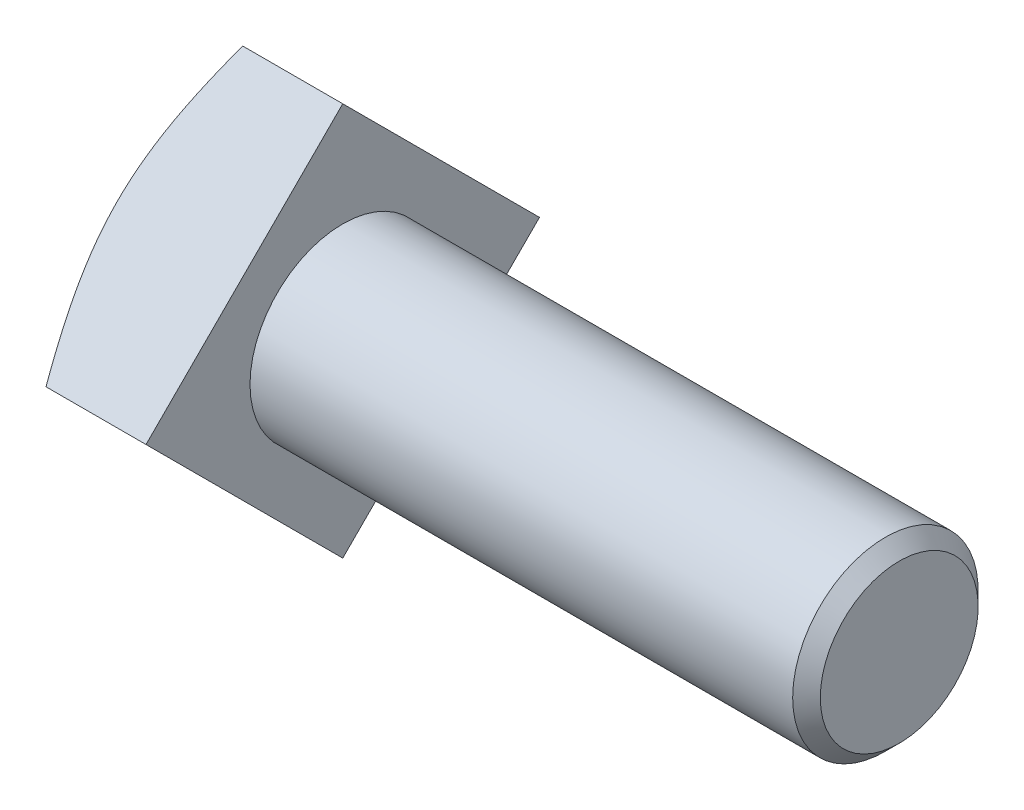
ISO-10303-21;
HEADER;
FILE_DESCRIPTION(('STEP AP214'),'2;1');
FILE_NAME('part.step','',(''),(''),'','','');
FILE_SCHEMA(('AUTOMOTIVE_DESIGN { 1 0 10303 214 1 1 1 1 }'));
ENDSEC;
DATA;
#1=APPLICATION_CONTEXT('core data for automotive mechanical design processes');
#2=APPLICATION_PROTOCOL_DEFINITION('international standard','automotive_design',2000,#1);
#3=PRODUCT_CONTEXT('',#1,'mechanical');
#4=PRODUCT('Part','Part','',(#3));
#5=PRODUCT_RELATED_PRODUCT_CATEGORY('part','',(#4));
#6=PRODUCT_DEFINITION_FORMATION('','',#4);
#7=PRODUCT_DEFINITION_CONTEXT('part definition',#1,'design');
#8=PRODUCT_DEFINITION('design','',#6,#7);
#9=PRODUCT_DEFINITION_SHAPE('','',#8);
#10=(LENGTH_UNIT() NAMED_UNIT(*) SI_UNIT(.MILLI.,.METRE.));
#11=(NAMED_UNIT(*) PLANE_ANGLE_UNIT() SI_UNIT($,.RADIAN.));
#12=(NAMED_UNIT(*) SI_UNIT($,.STERADIAN.) SOLID_ANGLE_UNIT());
#13=UNCERTAINTY_MEASURE_WITH_UNIT(LENGTH_MEASURE(1.E-05),#10,'distance_accuracy_value','');
#14=(GEOMETRIC_REPRESENTATION_CONTEXT(3) GLOBAL_UNCERTAINTY_ASSIGNED_CONTEXT((#13)) GLOBAL_UNIT_ASSIGNED_CONTEXT((#10,
#11,#12)) REPRESENTATION_CONTEXT('',''));
#15=CARTESIAN_POINT('',(0.,0.,0.));
#16=DIRECTION('',(0.,0.,1.));
#17=DIRECTION('',(1.,0.,0.));
#18=AXIS2_PLACEMENT_3D('',#15,#16,#17);
#19=CARTESIAN_POINT('',(17.3736,0.,-26.9407683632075));
#20=DIRECTION('',(0.,-0.707106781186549,0.707106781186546));
#21=DIRECTION('',(0.,-0.707106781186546,-0.707106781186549));
#22=AXIS2_PLACEMENT_3D('',#19,#20,#21);
#23=PLANE('',#22);
#24=CARTESIAN_POINT('',(3.67961897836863,26.9409683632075,0.000200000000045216));
#25=CARTESIAN_POINT('',(3.5548106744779,26.6733023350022,-0.267466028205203));
#26=CARTESIAN_POINT('',(3.43166591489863,26.4052457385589,-0.535522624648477));
#27=CARTESIAN_POINT('',(3.1890899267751,25.8682845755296,-1.0724837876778));
#28=CARTESIAN_POINT('',(3.06965881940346,25.5993799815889,-1.34138838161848));
#29=CARTESIAN_POINT('',(2.83485734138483,25.0605646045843,-1.88020375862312));
#30=CARTESIAN_POINT('',(2.71948863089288,24.7906534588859,-2.15011490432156));
#31=CARTESIAN_POINT('',(2.49331484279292,24.2498808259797,-2.69088753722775));
#32=CARTESIAN_POINT('',(2.38250972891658,23.9790193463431,-2.96174901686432));
#33=CARTESIAN_POINT('',(2.05612530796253,23.1610744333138,-3.77969392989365));
#34=CARTESIAN_POINT('',(1.84824930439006,22.6124346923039,-4.32833367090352));
#35=CARTESIAN_POINT('',(1.45758123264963,21.5107337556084,-5.430034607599));
#36=CARTESIAN_POINT('',(1.27478662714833,20.9576730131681,-5.9830953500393));
#37=CARTESIAN_POINT('',(0.945511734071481,19.8664326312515,-7.07433573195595));
#38=CARTESIAN_POINT('',(0.79798088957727,19.3284131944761,-7.61235516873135));
#39=CARTESIAN_POINT('',(0.536422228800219,18.2482773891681,-8.69249097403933));
#40=CARTESIAN_POINT('',(0.422394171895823,17.7061610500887,-9.23460731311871));
#41=CARTESIAN_POINT('',(0.233146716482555,16.6203771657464,-10.3203911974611));
#42=CARTESIAN_POINT('',(0.157794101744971,16.0767215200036,-10.8640468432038));
#43=CARTESIAN_POINT('',(0.0762638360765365,15.2597076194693,-11.6810607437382));
#44=CARTESIAN_POINT('',(0.0543365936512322,14.9871029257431,-11.9536654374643));
#45=CARTESIAN_POINT('',(0.0212582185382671,14.4415698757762,-12.4991984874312));
#46=CARTESIAN_POINT('',(0.0101066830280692,14.1686415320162,-12.7721268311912));
#47=CARTESIAN_POINT('',(-0.00161011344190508,13.605599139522,-13.3351692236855));
#48=CARTESIAN_POINT('',(-0.00146976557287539,13.3154776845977,-13.6252906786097));
#49=CARTESIAN_POINT('',(0.011159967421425,12.7353688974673,-14.2053994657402));
#50=CARTESIAN_POINT('',(0.0236494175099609,12.4453815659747,-14.4953867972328));
#51=CARTESIAN_POINT('',(0.0607802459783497,11.8657903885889,-15.0749779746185));
#52=CARTESIAN_POINT('',(0.0854218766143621,11.5761865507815,-15.364581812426));
#53=CARTESIAN_POINT('',(0.146470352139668,10.9975953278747,-15.9431730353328));
#54=CARTESIAN_POINT('',(0.182877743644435,10.7086079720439,-16.2321603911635));
#55=CARTESIAN_POINT('',(0.309293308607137,9.84074831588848,-17.100020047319));
#56=CARTESIAN_POINT('',(0.416353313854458,9.26308735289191,-17.6776810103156));
#57=CARTESIAN_POINT('',(0.670258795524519,8.11225138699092,-18.8285169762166));
#58=CARTESIAN_POINT('',(0.81710493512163,7.53907645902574,-19.4016919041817));
#59=CARTESIAN_POINT('',(1.15063001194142,6.37560138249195,-20.5651669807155));
#60=CARTESIAN_POINT('',(1.33862518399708,5.78549181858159,-21.1552765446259));
#61=CARTESIAN_POINT('',(1.74416737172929,4.61034109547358,-22.3304272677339));
#62=CARTESIAN_POINT('',(1.96171822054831,4.0253006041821,-22.9154677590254));
#63=CARTESIAN_POINT('',(2.30502412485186,3.15351567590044,-23.7872526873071));
#64=CARTESIAN_POINT('',(2.42180887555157,2.86498021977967,-24.0757881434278));
#65=CARTESIAN_POINT('',(2.66065189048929,2.28899759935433,-24.6517707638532));
#66=CARTESIAN_POINT('',(2.78271020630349,2.00155044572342,-24.9392179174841));
#67=CARTESIAN_POINT('',(3.03148171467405,1.42782962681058,-25.5129387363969));
#68=CARTESIAN_POINT('',(3.15819248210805,1.14155543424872,-25.7992129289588));
#69=CARTESIAN_POINT('',(3.41584794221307,0.569973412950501,-26.370794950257));
#70=CARTESIAN_POINT('',(3.54679246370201,0.284665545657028,-26.6561028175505));
#71=CARTESIAN_POINT('',(3.67961897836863,-0.000199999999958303,-26.9409683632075));
#72=B_SPLINE_CURVE_WITH_KNOTS('',3,(#24,#25,#26,#27,#28,#29,#30,#31,#32,#33,#34,#35,#36,#37,#38,
#39,#40,#41,#42,#43,#44,#45,#46,#47,#48,#49,#50,#51,#52,#53,#54,#55,#56,#57,#58,#59,#60,#61,#62,
#63,#64,#65,#66,#67,#68,#69,#70,#71),.UNSPECIFIED.,.F.,.F.,(4,2,2,2,2,2,2,2,2,2,2,2,2,2,2,2,2,2,
2,2,2,2,2,4),(0.,1.19574621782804,2.39153141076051,3.5877997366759,4.78405855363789,
7.1934730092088,9.60264353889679,11.9271362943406,14.2516123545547,16.5680271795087,
17.726333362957,18.8845962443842,20.1152898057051,21.3459898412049,22.5767154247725,
23.8074981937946,26.2780083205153,28.7485596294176,31.3142561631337,33.8802857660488,
35.1535601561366,36.4268470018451,37.6994793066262,38.9720602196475),.UNSPECIFIED.);
#73=CARTESIAN_POINT('',(3.67952571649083,26.9407683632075,0.));
#74=VERTEX_POINT('',#73);
#75=CARTESIAN_POINT('',(0.,13.4703841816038,-13.4703841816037));
#76=VERTEX_POINT('',#75);
#77=EDGE_CURVE('E115',#74,#76,#72,.T.);
#78=ORIENTED_EDGE('',*,*,#77,.F.);
#79=DIRECTION('',(-1.,0.,0.));
#80=VECTOR('',#79,1.);
#81=CARTESIAN_POINT('',(17.3736,26.9407683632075,0.));
#82=LINE('',#81,#80);
#83=CARTESIAN_POINT('',(17.3736,26.9407683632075,0.));
#84=VERTEX_POINT('',#83);
#85=EDGE_CURVE('E121',#84,#74,#82,.T.);
#86=ORIENTED_EDGE('',*,*,#85,.F.);
#87=DIRECTION('',(0.,0.707106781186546,0.707106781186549));
#88=VECTOR('',#87,1.);
#89=CARTESIAN_POINT('',(17.3736,0.,-26.9407683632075));
#90=LINE('',#89,#88);
#91=CARTESIAN_POINT('',(17.3736,0.,-26.9407683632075));
#92=VERTEX_POINT('',#91);
#93=EDGE_CURVE('E243',#92,#84,#90,.T.);
#94=ORIENTED_EDGE('',*,*,#93,.F.);
#95=DIRECTION('',(-1.,0.,0.));
#96=VECTOR('',#95,1.);
#97=CARTESIAN_POINT('',(17.3736,0.,-26.9407683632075));
#98=LINE('',#97,#96);
#99=CARTESIAN_POINT('',(3.67952571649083,0.,-26.9407683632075));
#100=VERTEX_POINT('',#99);
#101=EDGE_CURVE('E229',#92,#100,#98,.T.);
#102=ORIENTED_EDGE('',*,*,#101,.T.);
#103=EDGE_CURVE('E62',#76,#100,#72,.T.);
#104=ORIENTED_EDGE('',*,*,#103,.F.);
#105=EDGE_LOOP('',(#78,#86,#94,#102,#104));
#106=FACE_BOUND('',#105,.T.);
#107=ADVANCED_FACE('F41',(#106),#23,.F.);
#108=CARTESIAN_POINT('',(17.3736,0.,26.9407683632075));
#109=DIRECTION('',(0.,0.707106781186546,0.707106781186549));
#110=DIRECTION('',(0.,-0.707106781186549,0.707106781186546));
#111=AXIS2_PLACEMENT_3D('',#108,#109,#110);
#112=PLANE('',#111);
#113=ORIENTED_EDGE('',*,*,#85,.T.);
#114=CARTESIAN_POINT('',(3.67961897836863,26.9409683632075,-0.000199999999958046));
#115=CARTESIAN_POINT('',(3.5548106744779,26.6733023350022,0.267466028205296));
#116=CARTESIAN_POINT('',(3.43166591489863,26.4052457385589,0.535522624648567));
#117=CARTESIAN_POINT('',(3.1890899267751,25.8682845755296,1.07248378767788));
#118=CARTESIAN_POINT('',(3.06965881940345,25.5993799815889,1.34138838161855));
#119=CARTESIAN_POINT('',(2.83485734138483,25.0605646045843,1.8802037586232));
#120=CARTESIAN_POINT('',(2.71948863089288,24.7906534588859,2.15011490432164));
#121=CARTESIAN_POINT('',(2.49331484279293,24.2498808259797,2.69088753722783));
#122=CARTESIAN_POINT('',(2.38250972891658,23.9790193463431,2.9617490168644));
#123=CARTESIAN_POINT('',(2.05612530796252,23.1610744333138,3.77969392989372));
#124=CARTESIAN_POINT('',(1.84824930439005,22.6124346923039,4.3283336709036));
#125=CARTESIAN_POINT('',(1.45758123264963,21.5107337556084,5.43003460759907));
#126=CARTESIAN_POINT('',(1.27478662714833,20.9576730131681,5.98309535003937));
#127=CARTESIAN_POINT('',(0.945511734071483,19.8664326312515,7.07433573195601));
#128=CARTESIAN_POINT('',(0.797980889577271,19.3284131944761,7.61235516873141));
#129=CARTESIAN_POINT('',(0.536422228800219,18.2482773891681,8.69249097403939));
#130=CARTESIAN_POINT('',(0.422394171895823,17.7061610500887,9.23460731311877));
#131=CARTESIAN_POINT('',(0.233146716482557,16.6203771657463,10.3203911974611));
#132=CARTESIAN_POINT('',(0.157794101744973,16.0767215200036,10.8640468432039));
#133=CARTESIAN_POINT('',(0.0762638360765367,15.2597076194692,11.6810607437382));
#134=CARTESIAN_POINT('',(0.0543365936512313,14.9871029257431,11.9536654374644));
#135=CARTESIAN_POINT('',(0.0212582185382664,14.4415698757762,12.4991984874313));
#136=CARTESIAN_POINT('',(0.0101066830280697,14.1686415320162,12.7721268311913));
#137=CARTESIAN_POINT('',(-0.00161011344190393,13.6055991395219,13.3351692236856));
#138=CARTESIAN_POINT('',(-0.00146976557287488,13.3154776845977,13.6252906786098));
#139=CARTESIAN_POINT('',(0.0111599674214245,12.7353688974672,14.2053994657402));
#140=CARTESIAN_POINT('',(0.02364941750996,12.4453815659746,14.4953867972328));
#141=CARTESIAN_POINT('',(0.0607802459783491,11.8657903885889,15.0749779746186));
#142=CARTESIAN_POINT('',(0.0854218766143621,11.5761865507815,15.364581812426));
#143=CARTESIAN_POINT('',(0.146470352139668,10.9975953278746,15.9431730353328));
#144=CARTESIAN_POINT('',(0.182877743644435,10.7086079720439,16.2321603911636));
#145=CARTESIAN_POINT('',(0.309293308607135,9.84074831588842,17.100020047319));
#146=CARTESIAN_POINT('',(0.416353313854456,9.26308735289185,17.6776810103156));
#147=CARTESIAN_POINT('',(0.670258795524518,8.11225138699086,18.8285169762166));
#148=CARTESIAN_POINT('',(0.81710493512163,7.53907645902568,19.4016919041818));
#149=CARTESIAN_POINT('',(1.15063001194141,6.37560138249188,20.5651669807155));
#150=CARTESIAN_POINT('',(1.33862518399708,5.78549181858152,21.1552765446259));
#151=CARTESIAN_POINT('',(1.74416737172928,4.61034109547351,22.3304272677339));
#152=CARTESIAN_POINT('',(1.96171822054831,4.02530060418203,22.9154677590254));
#153=CARTESIAN_POINT('',(2.30502412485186,3.15351567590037,23.7872526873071));
#154=CARTESIAN_POINT('',(2.42180887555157,2.86498021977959,24.0757881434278));
#155=CARTESIAN_POINT('',(2.66065189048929,2.28899759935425,24.6517707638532));
#156=CARTESIAN_POINT('',(2.78271020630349,2.00155044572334,24.9392179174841));
#157=CARTESIAN_POINT('',(3.03148171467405,1.42782962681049,25.5129387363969));
#158=CARTESIAN_POINT('',(3.15819248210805,1.14155543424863,25.7992129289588));
#159=CARTESIAN_POINT('',(3.41584794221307,0.569973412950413,26.370794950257));
#160=CARTESIAN_POINT('',(3.54679246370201,0.284665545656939,26.6561028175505));
#161=CARTESIAN_POINT('',(3.67961897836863,-0.0002000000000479,26.9409683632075));
#162=B_SPLINE_CURVE_WITH_KNOTS('',3,(#114,#115,#116,#117,#118,#119,#120,#121,#122,#123,#124,
#125,#126,#127,#128,#129,#130,#131,#132,#133,#134,#135,#136,#137,#138,#139,#140,#141,#142,#143,
#144,#145,#146,#147,#148,#149,#150,#151,#152,#153,#154,#155,#156,#157,#158,#159,#160,#161),
.UNSPECIFIED.,.F.,.F.,(4,2,2,2,2,2,2,2,2,2,2,2,2,2,2,2,2,2,2,2,2,2,2,4),(0.,1.19574621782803,
2.39153141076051,3.5877997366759,4.78405855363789,7.1934730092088,9.60264353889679,
11.9271362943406,14.2516123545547,16.5680271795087,17.726333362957,18.8845962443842,
20.1152898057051,21.3459898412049,22.5767154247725,23.8074981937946,26.2780083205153,
28.7485596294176,31.3142561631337,33.8802857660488,35.1535601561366,36.4268470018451,
37.6994793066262,38.9720602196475),.UNSPECIFIED.);
#163=CARTESIAN_POINT('',(0.,13.4703841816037,13.4703841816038));
#164=VERTEX_POINT('',#163);
#165=EDGE_CURVE('E102',#74,#164,#162,.T.);
#166=ORIENTED_EDGE('',*,*,#165,.T.);
#167=CARTESIAN_POINT('',(3.67952571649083,0.,26.9407683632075));
#168=VERTEX_POINT('',#167);
#169=EDGE_CURVE('E92',#164,#168,#162,.T.);
#170=ORIENTED_EDGE('',*,*,#169,.T.);
#171=DIRECTION('',(-1.,0.,0.));
#172=VECTOR('',#171,1.);
#173=CARTESIAN_POINT('',(17.3736,0.,26.9407683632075));
#174=LINE('',#173,#172);
#175=CARTESIAN_POINT('',(17.3736,0.,26.9407683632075));
#176=VERTEX_POINT('',#175);
#177=EDGE_CURVE('E223',#176,#168,#174,.T.);
#178=ORIENTED_EDGE('',*,*,#177,.F.);
#179=DIRECTION('',(0.,0.707106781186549,-0.707106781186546));
#180=VECTOR('',#179,1.);
#181=CARTESIAN_POINT('',(17.3736,0.,26.9407683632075));
#182=LINE('',#181,#180);
#183=EDGE_CURVE('E239',#176,#84,#182,.T.);
#184=ORIENTED_EDGE('',*,*,#183,.T.);
#185=EDGE_LOOP('',(#113,#166,#170,#178,#184));
#186=FACE_BOUND('',#185,.T.);
#187=ADVANCED_FACE('F122',(#186),#112,.T.);
#188=CARTESIAN_POINT('',(17.3736,0.,26.9407683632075));
#189=DIRECTION('',(0.,0.707106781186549,-0.707106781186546));
#190=DIRECTION('',(0.,0.707106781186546,0.707106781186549));
#191=AXIS2_PLACEMENT_3D('',#188,#189,#190);
#192=PLANE('',#191);
#193=CARTESIAN_POINT('',(3.67961897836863,-26.9409683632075,-0.000200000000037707));
#194=CARTESIAN_POINT('',(3.5548106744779,-26.6733023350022,0.267466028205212));
#195=CARTESIAN_POINT('',(3.43166591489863,-26.4052457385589,0.535522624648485));
#196=CARTESIAN_POINT('',(3.1890899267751,-25.8682845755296,1.07248378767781));
#197=CARTESIAN_POINT('',(3.06965881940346,-25.5993799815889,1.34138838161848));
#198=CARTESIAN_POINT('',(2.83485734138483,-25.0605646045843,1.88020375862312));
#199=CARTESIAN_POINT('',(2.71948863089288,-24.7906534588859,2.15011490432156));
#200=CARTESIAN_POINT('',(2.49331484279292,-24.2498808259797,2.69088753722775));
#201=CARTESIAN_POINT('',(2.38250972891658,-23.9790193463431,2.96174901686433));
#202=CARTESIAN_POINT('',(2.05612530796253,-23.1610744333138,3.77969392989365));
#203=CARTESIAN_POINT('',(1.84824930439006,-22.6124346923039,4.32833367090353));
#204=CARTESIAN_POINT('',(1.45758123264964,-21.5107337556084,5.430034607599));
#205=CARTESIAN_POINT('',(1.27478662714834,-20.9576730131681,5.98309535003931));
#206=CARTESIAN_POINT('',(0.945511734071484,-19.8664326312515,7.07433573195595));
#207=CARTESIAN_POINT('',(0.797980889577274,-19.3284131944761,7.61235516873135));
#208=CARTESIAN_POINT('',(0.536422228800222,-18.2482773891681,8.69249097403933));
#209=CARTESIAN_POINT('',(0.422394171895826,-17.7061610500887,9.23460731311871));
#210=CARTESIAN_POINT('',(0.233146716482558,-16.6203771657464,10.3203911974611));
#211=CARTESIAN_POINT('',(0.157794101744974,-16.0767215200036,10.8640468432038));
#212=CARTESIAN_POINT('',(0.0762638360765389,-15.2597076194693,11.6810607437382));
#213=CARTESIAN_POINT('',(0.0543365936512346,-14.9871029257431,11.9536654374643));
#214=CARTESIAN_POINT('',(0.0212582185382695,-14.4415698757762,12.4991984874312));
#215=CARTESIAN_POINT('',(0.0101066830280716,-14.1686415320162,12.7721268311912));
#216=CARTESIAN_POINT('',(-0.0016101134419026,-13.605599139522,13.3351692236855));
#217=CARTESIAN_POINT('',(-0.00146976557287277,-13.3154776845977,13.6252906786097));
#218=CARTESIAN_POINT('',(0.0111599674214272,-12.7353688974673,14.2053994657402));
#219=CARTESIAN_POINT('',(0.0236494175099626,-12.4453815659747,14.4953867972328));
#220=CARTESIAN_POINT('',(0.0607802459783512,-11.8657903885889,15.0749779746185));
#221=CARTESIAN_POINT('',(0.0854218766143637,-11.5761865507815,15.364581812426));
#222=CARTESIAN_POINT('',(0.146470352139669,-10.9975953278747,15.9431730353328));
#223=CARTESIAN_POINT('',(0.182877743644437,-10.7086079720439,16.2321603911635));
#224=CARTESIAN_POINT('',(0.309293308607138,-9.84074831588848,17.100020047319));
#225=CARTESIAN_POINT('',(0.416353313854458,-9.26308735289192,17.6776810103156));
#226=CARTESIAN_POINT('',(0.670258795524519,-8.11225138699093,18.8285169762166));
#227=CARTESIAN_POINT('',(0.817104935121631,-7.53907645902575,19.4016919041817));
#228=CARTESIAN_POINT('',(1.15063001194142,-6.37560138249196,20.5651669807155));
#229=CARTESIAN_POINT('',(1.33862518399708,-5.7854918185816,21.1552765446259));
#230=CARTESIAN_POINT('',(1.74416737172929,-4.61034109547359,22.3304272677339));
#231=CARTESIAN_POINT('',(1.96171822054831,-4.02530060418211,22.9154677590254));
#232=CARTESIAN_POINT('',(2.30502412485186,-3.15351567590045,23.787252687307));
#233=CARTESIAN_POINT('',(2.42180887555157,-2.86498021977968,24.0757881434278));
#234=CARTESIAN_POINT('',(2.66065189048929,-2.28899759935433,24.6517707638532));
#235=CARTESIAN_POINT('',(2.78271020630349,-2.00155044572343,24.9392179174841));
#236=CARTESIAN_POINT('',(3.03148171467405,-1.42782962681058,25.5129387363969));
#237=CARTESIAN_POINT('',(3.15819248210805,-1.14155543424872,25.7992129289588));
#238=CARTESIAN_POINT('',(3.41584794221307,-0.569973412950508,26.370794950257));
#239=CARTESIAN_POINT('',(3.54679246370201,-0.284665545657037,26.6561028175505));
#240=CARTESIAN_POINT('',(3.67961897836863,0.000199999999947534,26.9409683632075));
#241=B_SPLINE_CURVE_WITH_KNOTS('',3,(#193,#194,#195,#196,#197,#198,#199,#200,#201,#202,#203,
#204,#205,#206,#207,#208,#209,#210,#211,#212,#213,#214,#215,#216,#217,#218,#219,#220,#221,#222,
#223,#224,#225,#226,#227,#228,#229,#230,#231,#232,#233,#234,#235,#236,#237,#238,#239,#240),
.UNSPECIFIED.,.F.,.F.,(4,2,2,2,2,2,2,2,2,2,2,2,2,2,2,2,2,2,2,2,2,2,2,4),(0.,1.19574621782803,
2.39153141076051,3.5877997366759,4.78405855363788,7.1934730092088,9.60264353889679,
11.9271362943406,14.2516123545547,16.5680271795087,17.726333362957,18.8845962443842,
20.1152898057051,21.3459898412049,22.5767154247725,23.8074981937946,26.2780083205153,
28.7485596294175,31.3142561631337,33.8802857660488,35.1535601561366,36.4268470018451,
37.6994793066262,38.9720602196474),.UNSPECIFIED.);
#242=CARTESIAN_POINT('',(3.67952571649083,-26.9407683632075,0.));
#243=VERTEX_POINT('',#242);
#244=CARTESIAN_POINT('',(0.,-13.4703841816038,13.4703841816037));
#245=VERTEX_POINT('',#244);
#246=EDGE_CURVE('E163',#243,#245,#241,.T.);
#247=ORIENTED_EDGE('',*,*,#246,.F.);
#248=DIRECTION('',(-1.,0.,0.));
#249=VECTOR('',#248,1.);
#250=CARTESIAN_POINT('',(17.3736,-26.9407683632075,0.));
#251=LINE('',#250,#249);
#252=CARTESIAN_POINT('',(17.3736,-26.9407683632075,0.));
#253=VERTEX_POINT('',#252);
#254=EDGE_CURVE('E228',#253,#243,#251,.T.);
#255=ORIENTED_EDGE('',*,*,#254,.F.);
#256=DIRECTION('',(0.,-0.707106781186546,-0.707106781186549));
#257=VECTOR('',#256,1.);
#258=CARTESIAN_POINT('',(17.3736,0.,26.9407683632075));
#259=LINE('',#258,#257);
#260=EDGE_CURVE('E240',#176,#253,#259,.T.);
#261=ORIENTED_EDGE('',*,*,#260,.F.);
#262=ORIENTED_EDGE('',*,*,#177,.T.);
#263=EDGE_CURVE('E99',#245,#168,#241,.T.);
#264=ORIENTED_EDGE('',*,*,#263,.F.);
#265=EDGE_LOOP('',(#247,#255,#261,#262,#264));
#266=FACE_BOUND('',#265,.T.);
#267=ADVANCED_FACE('F166',(#266),#192,.F.);
#268=CARTESIAN_POINT('',(17.3736,0.,-26.9407683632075));
#269=DIRECTION('',(0.,-0.707106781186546,-0.707106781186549));
#270=DIRECTION('',(0.,0.707106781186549,-0.707106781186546));
#271=AXIS2_PLACEMENT_3D('',#268,#269,#270);
#272=PLANE('',#271);
#273=ORIENTED_EDGE('',*,*,#254,.T.);
#274=CARTESIAN_POINT('',(3.67961897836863,-26.9409683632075,0.000199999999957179));
#275=CARTESIAN_POINT('',(3.5548106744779,-26.6733023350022,-0.267466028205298));
#276=CARTESIAN_POINT('',(3.43166591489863,-26.4052457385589,-0.535522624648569));
#277=CARTESIAN_POINT('',(3.1890899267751,-25.8682845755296,-1.07248378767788));
#278=CARTESIAN_POINT('',(3.06965881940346,-25.5993799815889,-1.34138838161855));
#279=CARTESIAN_POINT('',(2.83485734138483,-25.0605646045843,-1.8802037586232));
#280=CARTESIAN_POINT('',(2.71948863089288,-24.7906534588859,-2.15011490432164));
#281=CARTESIAN_POINT('',(2.49331484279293,-24.2498808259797,-2.69088753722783));
#282=CARTESIAN_POINT('',(2.38250972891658,-23.9790193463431,-2.9617490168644));
#283=CARTESIAN_POINT('',(2.05612530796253,-23.1610744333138,-3.77969392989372));
#284=CARTESIAN_POINT('',(1.84824930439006,-22.6124346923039,-4.32833367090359));
#285=CARTESIAN_POINT('',(1.45758123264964,-21.5107337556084,-5.43003460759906));
#286=CARTESIAN_POINT('',(1.27478662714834,-20.9576730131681,-5.98309535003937));
#287=CARTESIAN_POINT('',(0.945511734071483,-19.8664326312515,-7.07433573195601));
#288=CARTESIAN_POINT('',(0.797980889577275,-19.3284131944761,-7.61235516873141));
#289=CARTESIAN_POINT('',(0.536422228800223,-18.2482773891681,-8.69249097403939));
#290=CARTESIAN_POINT('',(0.422394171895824,-17.7061610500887,-9.23460731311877));
#291=CARTESIAN_POINT('',(0.233146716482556,-16.6203771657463,-10.3203911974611));
#292=CARTESIAN_POINT('',(0.157794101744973,-16.0767215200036,-10.8640468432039));
#293=CARTESIAN_POINT('',(0.076263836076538,-15.2597076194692,-11.6810607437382));
#294=CARTESIAN_POINT('',(0.054336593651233,-14.9871029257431,-11.9536654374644));
#295=CARTESIAN_POINT('',(0.0212582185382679,-14.4415698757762,-12.4991984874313));
#296=CARTESIAN_POINT('',(0.0101066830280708,-14.1686415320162,-12.7721268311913));
#297=CARTESIAN_POINT('',(-0.00161011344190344,-13.6055991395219,-13.3351692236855));
#298=CARTESIAN_POINT('',(-0.00146976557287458,-13.3154776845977,-13.6252906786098));
#299=CARTESIAN_POINT('',(0.0111599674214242,-12.7353688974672,-14.2053994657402));
#300=CARTESIAN_POINT('',(0.0236494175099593,-12.4453815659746,-14.4953867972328));
#301=CARTESIAN_POINT('',(0.0607802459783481,-11.8657903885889,-15.0749779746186));
#302=CARTESIAN_POINT('',(0.0854218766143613,-11.5761865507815,-15.364581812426));
#303=CARTESIAN_POINT('',(0.146470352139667,-10.9975953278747,-15.9431730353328));
#304=CARTESIAN_POINT('',(0.182877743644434,-10.7086079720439,-16.2321603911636));
#305=CARTESIAN_POINT('',(0.309293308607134,-9.84074831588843,-17.100020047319));
#306=CARTESIAN_POINT('',(0.416353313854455,-9.26308735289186,-17.6776810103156));
#307=CARTESIAN_POINT('',(0.670258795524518,-8.11225138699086,-18.8285169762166));
#308=CARTESIAN_POINT('',(0.81710493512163,-7.53907645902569,-19.4016919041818));
#309=CARTESIAN_POINT('',(1.15063001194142,-6.37560138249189,-20.5651669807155));
#310=CARTESIAN_POINT('',(1.33862518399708,-5.78549181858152,-21.1552765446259));
#311=CARTESIAN_POINT('',(1.74416737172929,-4.61034109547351,-22.3304272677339));
#312=CARTESIAN_POINT('',(1.96171822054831,-4.02530060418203,-22.9154677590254));
#313=CARTESIAN_POINT('',(2.30502412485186,-3.15351567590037,-23.7872526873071));
#314=CARTESIAN_POINT('',(2.42180887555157,-2.86498021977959,-24.0757881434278));
#315=CARTESIAN_POINT('',(2.66065189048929,-2.28899759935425,-24.6517707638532));
#316=CARTESIAN_POINT('',(2.78271020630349,-2.00155044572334,-24.9392179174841));
#317=CARTESIAN_POINT('',(3.03148171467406,-1.42782962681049,-25.5129387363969));
#318=CARTESIAN_POINT('',(3.15819248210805,-1.14155543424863,-25.7992129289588));
#319=CARTESIAN_POINT('',(3.41584794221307,-0.569973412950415,-26.370794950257));
#320=CARTESIAN_POINT('',(3.54679246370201,-0.284665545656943,-26.6561028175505));
#321=CARTESIAN_POINT('',(3.67961897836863,0.00020000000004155,-26.9409683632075));
#322=B_SPLINE_CURVE_WITH_KNOTS('',3,(#274,#275,#276,#277,#278,#279,#280,#281,#282,#283,#284,
#285,#286,#287,#288,#289,#290,#291,#292,#293,#294,#295,#296,#297,#298,#299,#300,#301,#302,#303,
#304,#305,#306,#307,#308,#309,#310,#311,#312,#313,#314,#315,#316,#317,#318,#319,#320,#321),
.UNSPECIFIED.,.F.,.F.,(4,2,2,2,2,2,2,2,2,2,2,2,2,2,2,2,2,2,2,2,2,2,2,4),(0.,1.19574621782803,
2.39153141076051,3.58779973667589,4.78405855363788,7.19347300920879,9.60264353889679,
11.9271362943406,14.2516123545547,16.5680271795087,17.726333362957,18.8845962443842,
20.1152898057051,21.3459898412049,22.5767154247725,23.8074981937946,26.2780083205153,
28.7485596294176,31.3142561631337,33.8802857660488,35.1535601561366,36.4268470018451,
37.6994793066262,38.9720602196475),.UNSPECIFIED.);
#323=CARTESIAN_POINT('',(0.,-13.4703841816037,-13.4703841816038));
#324=VERTEX_POINT('',#323);
#325=EDGE_CURVE('E170',#243,#324,#322,.T.);
#326=ORIENTED_EDGE('',*,*,#325,.T.);
#327=EDGE_CURVE('E116',#324,#100,#322,.T.);
#328=ORIENTED_EDGE('',*,*,#327,.T.);
#329=ORIENTED_EDGE('',*,*,#101,.F.);
#330=DIRECTION('',(0.,-0.707106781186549,0.707106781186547));
#331=VECTOR('',#330,1.);
#332=CARTESIAN_POINT('',(17.3736,0.,-26.9407683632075));
#333=LINE('',#332,#331);
#334=EDGE_CURVE('E231',#92,#253,#333,.T.);
#335=ORIENTED_EDGE('',*,*,#334,.T.);
#336=EDGE_LOOP('',(#273,#326,#328,#329,#335));
#337=FACE_BOUND('',#336,.T.);
#338=ADVANCED_FACE('F171',(#337),#272,.T.);
#339=CARTESIAN_POINT('',(17.3736,0.,-26.9407683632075));
#340=DIRECTION('',(1.,0.,0.));
#341=DIRECTION('',(0.,0.,-1.));
#342=AXIS2_PLACEMENT_3D('',#339,#340,#341);
#343=PLANE('',#342);
#344=CARTESIAN_POINT('',(17.3736,0.,0.));
#345=DIRECTION('',(1.,0.,0.));
#346=DIRECTION('',(0.,0.,-1.));
#347=AXIS2_PLACEMENT_3D('',#344,#345,#346);
#348=CIRCLE('',#347,12.7);
#349=CARTESIAN_POINT('',(17.3736,0.,-12.7));
#350=VERTEX_POINT('',#349);
#351=EDGE_CURVE('E212',#350,#350,#348,.T.);
#352=ORIENTED_EDGE('',*,*,#351,.F.);
#353=EDGE_LOOP('',(#352));
#354=FACE_BOUND('',#353,.T.);
#355=ORIENTED_EDGE('',*,*,#93,.T.);
#356=ORIENTED_EDGE('',*,*,#183,.F.);
#357=ORIENTED_EDGE('',*,*,#260,.T.);
#358=ORIENTED_EDGE('',*,*,#334,.F.);
#359=EDGE_LOOP('',(#355,#356,#357,#358));
#360=FACE_BOUND('',#359,.T.);
#361=ADVANCED_FACE('F176',(#354,#360),#343,.T.);
#362=CARTESIAN_POINT('',(0.,0.,0.));
#363=DIRECTION('',(-1.,0.,0.));
#364=DIRECTION('',(0.,0.,1.));
#365=AXIS2_PLACEMENT_3D('',#362,#363,#364);
#366=CYLINDRICAL_SURFACE('',#365,12.7);
#367=CARTESIAN_POINT('',(91.6813,0.,0.));
#368=DIRECTION('',(-1.,0.,0.));
#369=DIRECTION('',(0.,0.,1.));
#370=AXIS2_PLACEMENT_3D('',#367,#368,#369);
#371=CIRCLE('',#370,12.7);
#372=CARTESIAN_POINT('',(91.6813,0.,12.7));
#373=VERTEX_POINT('',#372);
#374=EDGE_CURVE('E126',#373,#373,#371,.T.);
#375=ORIENTED_EDGE('',*,*,#374,.T.);
#376=EDGE_LOOP('',(#375));
#377=FACE_BOUND('',#376,.T.);
#378=ORIENTED_EDGE('',*,*,#351,.T.);
#379=EDGE_LOOP('',(#378));
#380=FACE_BOUND('',#379,.T.);
#381=ADVANCED_FACE('F185',(#377,#380),#366,.T.);
#382=CARTESIAN_POINT('',(91.6813,0.,0.));
#383=DIRECTION('',(-1.,0.,0.));
#384=DIRECTION('',(0.,0.,1.));
#385=AXIS2_PLACEMENT_3D('',#382,#383,#384);
#386=CONICAL_SURFACE('',#385,12.7,0.785398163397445);
#387=CARTESIAN_POINT('',(93.5736,0.,0.));
#388=DIRECTION('',(-1.,0.,0.));
#389=DIRECTION('',(0.,0.,1.));
#390=AXIS2_PLACEMENT_3D('',#387,#388,#389);
#391=CIRCLE('',#390,10.8077);
#392=CARTESIAN_POINT('',(93.5736,0.,10.8077));
#393=VERTEX_POINT('',#392);
#394=EDGE_CURVE('E128',#393,#393,#391,.T.);
#395=ORIENTED_EDGE('',*,*,#394,.T.);
#396=EDGE_LOOP('',(#395));
#397=FACE_BOUND('',#396,.T.);
#398=ORIENTED_EDGE('',*,*,#374,.F.);
#399=EDGE_LOOP('',(#398));
#400=FACE_BOUND('',#399,.T.);
#401=ADVANCED_FACE('F184',(#397,#400),#386,.T.);
#402=CARTESIAN_POINT('',(93.5736,10.8077,0.));
#403=DIRECTION('',(1.,0.,0.));
#404=DIRECTION('',(0.,0.,-1.));
#405=AXIS2_PLACEMENT_3D('',#402,#403,#404);
#406=PLANE('',#405);
#407=ORIENTED_EDGE('',*,*,#394,.F.);
#408=EDGE_LOOP('',(#407));
#409=FACE_BOUND('',#408,.T.);
#410=ADVANCED_FACE('F146',(#409),#406,.T.);
#411=CARTESIAN_POINT('',(0.,0.,0.));
#412=DIRECTION('',(1.,0.,0.));
#413=DIRECTION('',(0.,0.,-1.));
#414=AXIS2_PLACEMENT_3D('',#411,#412,#413);
#415=CONICAL_SURFACE('',#414,19.05,1.13446401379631);
#416=ORIENTED_EDGE('',*,*,#103,.T.);
#417=ORIENTED_EDGE('',*,*,#327,.F.);
#418=CARTESIAN_POINT('',(0.,0.,0.));
#419=DIRECTION('',(1.,0.,0.));
#420=DIRECTION('',(0.,0.,-1.));
#421=AXIS2_PLACEMENT_3D('',#418,#419,#420);
#422=CIRCLE('',#421,19.05);
#423=EDGE_CURVE('E44',#76,#324,#422,.F.);
#424=ORIENTED_EDGE('',*,*,#423,.F.);
#425=EDGE_LOOP('',(#416,#417,#424));
#426=FACE_BOUND('',#425,.T.);
#427=ADVANCED_FACE('F194',(#426),#415,.T.);
#428=ORIENTED_EDGE('',*,*,#77,.T.);
#429=CARTESIAN_POINT('',(0.,0.,0.));
#430=DIRECTION('',(-1.,0.,0.));
#431=DIRECTION('',(0.,0.,1.));
#432=AXIS2_PLACEMENT_3D('',#429,#430,#431);
#433=CIRCLE('',#432,19.05);
#434=EDGE_CURVE('E107',#164,#76,#433,.T.);
#435=ORIENTED_EDGE('',*,*,#434,.F.);
#436=ORIENTED_EDGE('',*,*,#165,.F.);
#437=EDGE_LOOP('',(#428,#435,#436));
#438=FACE_BOUND('',#437,.T.);
#439=ADVANCED_FACE('F109',(#438),#415,.T.);
#440=EDGE_CURVE('E51',#245,#164,#422,.F.);
#441=ORIENTED_EDGE('',*,*,#440,.F.);
#442=ORIENTED_EDGE('',*,*,#263,.T.);
#443=ORIENTED_EDGE('',*,*,#169,.F.);
#444=EDGE_LOOP('',(#441,#442,#443));
#445=FACE_BOUND('',#444,.T.);
#446=ADVANCED_FACE('F97',(#445),#415,.T.);
#447=ORIENTED_EDGE('',*,*,#246,.T.);
#448=EDGE_CURVE('E11',#324,#245,#422,.F.);
#449=ORIENTED_EDGE('',*,*,#448,.F.);
#450=ORIENTED_EDGE('',*,*,#325,.F.);
#451=EDGE_LOOP('',(#447,#449,#450));
#452=FACE_BOUND('',#451,.T.);
#453=ADVANCED_FACE('F150',(#452),#415,.T.);
#454=CARTESIAN_POINT('',(0.,0.,-26.9407683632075));
#455=DIRECTION('',(1.,0.,0.));
#456=DIRECTION('',(0.,0.,-1.));
#457=AXIS2_PLACEMENT_3D('',#454,#455,#456);
#458=PLANE('',#457);
#459=ORIENTED_EDGE('',*,*,#423,.T.);
#460=ORIENTED_EDGE('',*,*,#448,.T.);
#461=ORIENTED_EDGE('',*,*,#440,.T.);
#462=ORIENTED_EDGE('',*,*,#434,.T.);
#463=EDGE_LOOP('',(#459,#460,#461,#462));
#464=FACE_BOUND('',#463,.T.);
#465=ADVANCED_FACE('F117',(#464),#458,.F.);
#466=CLOSED_SHELL('',(#107,#187,#267,#338,#361,#381,#401,#410,#427,#439,#446,#453,#465));
#467=MANIFOLD_SOLID_BREP('B2',#466);
#468=ADVANCED_BREP_SHAPE_REPRESENTATION('',(#18,#467),#14);
#469=SHAPE_DEFINITION_REPRESENTATION(#9,#468);
ENDSEC;
END-ISO-10303-21;
